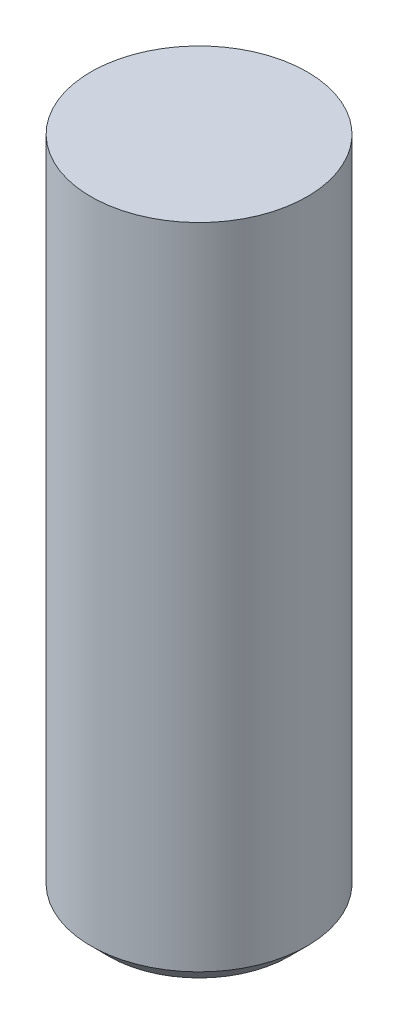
from build123d import *


with BuildPart() as part:
    # Esquisse1 → R_volution1 (revolve)
    with BuildSketch(Plane.XY, mode=Mode.PRIVATE) as r_volution1_sk:
        Polygon((6, 0), (0, 0), (0, -37), (4.999998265, -37), (6, -35.999998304), align=None)
    revolve(r_volution1_sk.sketch.rotate(Axis((0, 0, 0), (0, -1, 0)), 270), axis=Axis((0, 0, 0), (0, -1, 0)))


solid = part.part
